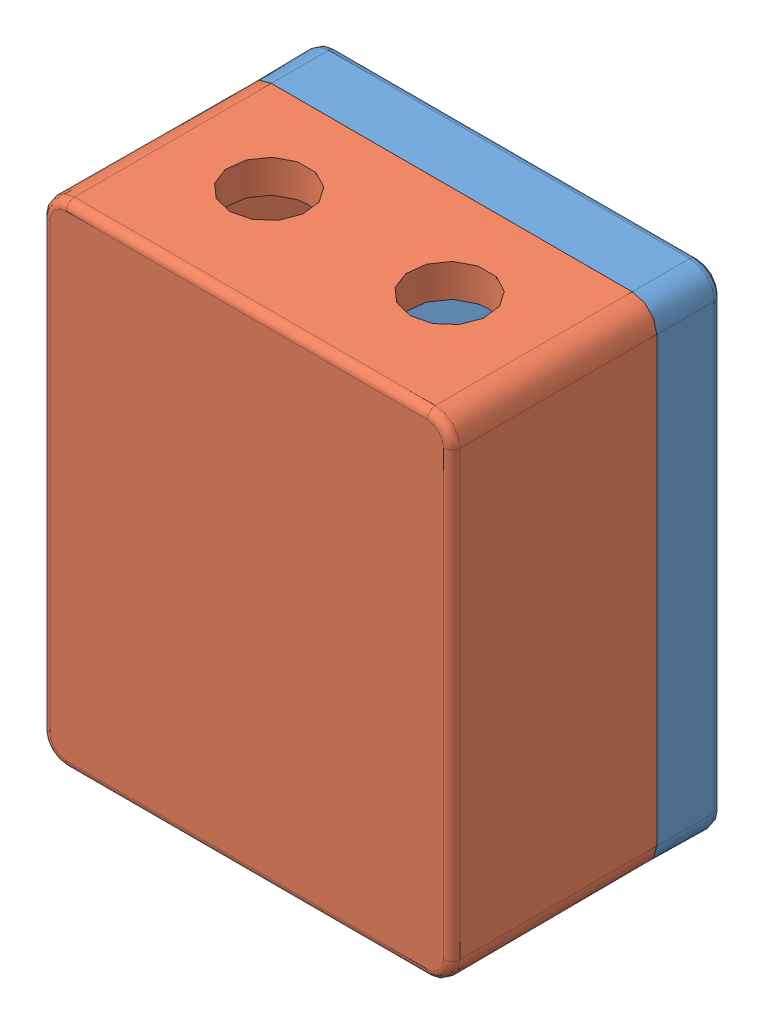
SolidWorks assembly Assem2.SLDASM, configuration Default (file format 6000). Lengths in mm.
Overall size (50 60 33).
2 component instances, 2 part files, 3 mates.
Components (placement in the parent):
- boxB-1: boxB.SLDPRT [Default] at (12.0633 14.1018 63.1996) size (50 60 8)
- boxA-1: boxA.SLDPRT [Default] at (12.0633 74.1018 96.1996) x (1 0 0) z (0 0 -1) size (50 60 30)
Mates (geometry in assembly coordinates):
- Coincident6: coincident anti-aligned: line of boxB-1 through (59.0633 74.1018 71.1996) axis (-1 0 0); line of boxA-1 through (15.0633 74.1018 71.1996) axis (1 0 0)
- Coincident7: coincident aligned: plane of boxB-1 through (62.0633 14.1018 71.1996) normal (1 0 0); plane of boxA-1 through (62.0633 74.1018 66.1996) normal (1 0 0)
- Coincident8: coincident aligned: plane of boxB-1 through (12.0633 14.1018 71.1996) normal (0 -1 0); plane of boxA-1 through (12.0633 14.1018 66.1996) normal (0 -1 0)
